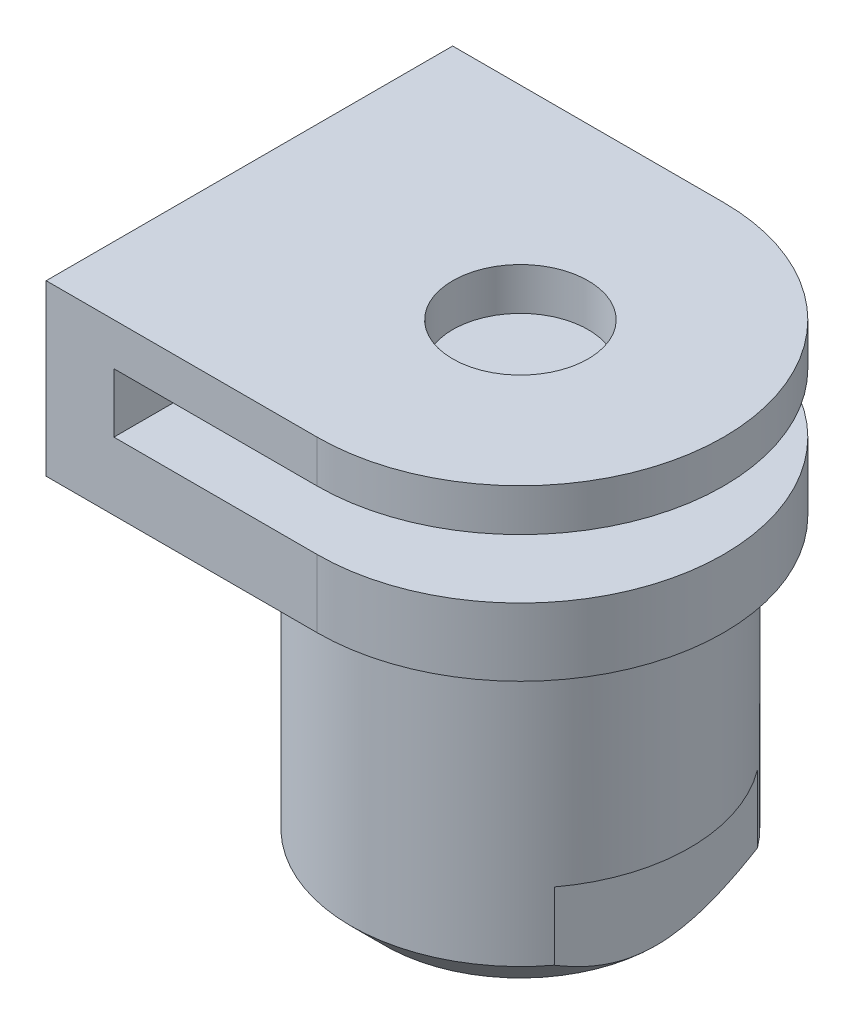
from build123d import *

# Parameters (mm, degrees)
SKETCH_1_R           = 5
SKETCH_1_R_2         = 2
EXTRUDE_1_DEPTH      = 9
CHAMFER_1_SIZE       = 1
SKETCH_2_W           = 5.204946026
SKETCH_2_H           = 11.043227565
SKETCH_2_W_2         = 5.66720314
CUT_EXTRUDE_1_DEPTH  = 3
SKETCH_3_R           = 2
EXTRUDE_2_DEPTH      = 2
EXTRUDE_3_DEPTH      = 3
EXTRUDE_3_DEPTH_BACK = 2
SKETCH_4_W           = 2
SKETCH_4_H           = 12
EXTRUDE_START        = -1.25
SKETCH_5_R           = 2
EXTRUDE_4_DEPTH      = 1.25
EXTRUDE_6_DEPTH      = 0.5
EXTRUDE_6_DEPTH_BACK = 0.5
EXTRUDE_7_REACH      = 20.788
SKETCH_7_W           = 1
SKETCH_7_H           = 4


with BuildPart() as part:
    # Sketch 1 → Extrude 1 (new body)
    with BuildSketch(Plane(origin=(0, 0, 0), x_dir=(1, 0, 0), z_dir=(0, 1, 0))):
        with Locations(Location((0, 0, 0), (0, 0, 270))):
            Circle(SKETCH_1_R)
        with Locations(Location((0, 0, 0), (0, 0, 270))):
            Circle(SKETCH_1_R_2, mode=Mode.SUBTRACT)
    extrude(amount=EXTRUDE_1_DEPTH)

    # Chamfer 1
    chamfer_1_edges = [part.edges().sort_by_distance(p)[0] for p in [
        (0, 0, -5),
    ]]
    chamfer(chamfer_1_edges, length=CHAMFER_1_SIZE)

    # Sketch 2 → Cut-Extrude 1 (cut)
    with BuildSketch(Plane(origin=(0, 0, 0), x_dir=(-1, 0, 0), z_dir=(0, -1, 0))):
        with Locations((6.602473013, 0.095815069)):
            Rectangle(SKETCH_2_W, SKETCH_2_H)
        with Locations((-6.83360157, 0.095815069)):
            Rectangle(SKETCH_2_W_2, SKETCH_2_H)
    extrude(amount=-CUT_EXTRUDE_1_DEPTH, mode=Mode.SUBTRACT)

    # Sketch 3 → Extrude 2 (add)
    with BuildSketch(Plane(origin=(0, 9, 0), x_dir=(1, 0, 0), z_dir=(0, 1, 0))):
        with BuildLine():
            Line((0, 6), (-6, 6))
            Line((-6, 6), (-6, -6))
            Line((-6, -6), (0, -6))
            ThreePointArc((0, -6), (6, 0), (0, 6))
        make_face()
        with Locations(Location((0, 0, 0), (0, 0, 270))):
            Circle(SKETCH_3_R, mode=Mode.SUBTRACT)
    extrude(amount=EXTRUDE_2_DEPTH)

    # Sketch 4 → Extrude 3 (add, two sides: drawn at the far end of the back side and taken through both)
    with BuildSketch(Plane(origin=(0, 11, 0), x_dir=(1, 0, 0), z_dir=(0, 1, 0)).offset(-EXTRUDE_3_DEPTH_BACK)):
        with Locations((-7, 0)):
            Rectangle(SKETCH_4_W, SKETCH_4_H)
    extrude(amount=EXTRUDE_3_DEPTH + EXTRUDE_3_DEPTH_BACK)

    # Sketch 5 → Extrude 4 (add)
    with BuildSketch(Plane(origin=(0, 14, 0), x_dir=(1, 0, 0), z_dir=(0, 1, 0)).offset(EXTRUDE_START)):
        with BuildLine():
            Line((-8, 6), (0, 6))
            ThreePointArc((0, 6), (6, 0), (0, -6))
            Line((0, -6), (-8, -6))
            Line((-8, -6), (-8, 6))
        make_face()
        with Locations(Location((0, 0, 0), (0, 0, 270))):
            Circle(SKETCH_5_R, mode=Mode.SUBTRACT)
    extrude(amount=EXTRUDE_4_DEPTH)

    # Sketch 7 → Extrude 7 (add, up to next)
    with BuildSketch(Plane(origin=(-5, 0, 0), x_dir=(0, 0, -1), z_dir=(1, 0, 0)), mode=Mode.PRIVATE) as extrude_7_sk1:
        with Locations((0, 7)):
            Rectangle(SKETCH_7_W, SKETCH_7_H)
    extrude_7_tool1 = extrude(extrude_7_sk1.sketch, amount=EXTRUDE_7_REACH, mode=Mode.PRIVATE) - part.part


with BuildPart() as body_2:
    # Sketch 1 2 → Extrude 6 (new, two sides: drawn at the far end of the back side and taken through both)
    with BuildSketch(Plane(origin=(-8, 9, 0), x_dir=(0.6000000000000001, -0.7999999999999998, 0), z_dir=(0, 0, 1)).offset(-EXTRUDE_6_DEPTH_BACK)):
        Polygon((0, 0), (1.8, 2.4), (5, 0), align=None)
    extrude(amount=EXTRUDE_6_DEPTH + EXTRUDE_6_DEPTH_BACK)


with BuildPart() as part_1:
    add(part.part)

    add(body_2.part)  # Extrude 7 merges body 2
    add(extrude_7_tool1.solids().sort_by_distance((-5, 7, 0))[0])
    add(extrude_7_tool1.solids().sort_by_distance((-5, 7, 0))[1])


solid = part_1.part
